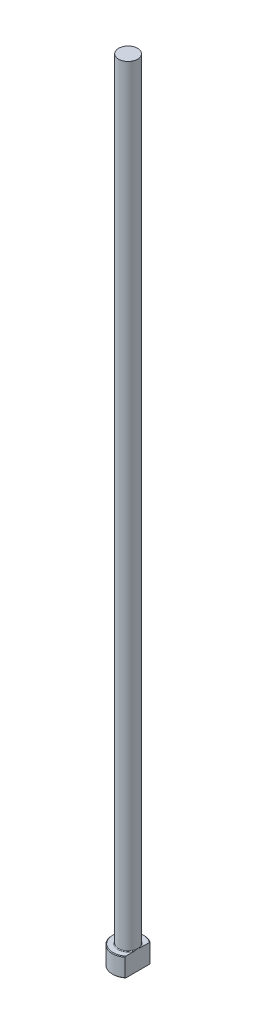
from build123d import *
from build123d.topology import SkipClean

# Parameters (mm, degrees)
CHAMFER1_SIZE    = 0.2
FILLET1_R        = 0.2
KEYED_HEAD_DEPTH = 251.099980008


with BuildPart() as part:
    # Sketch1 → Revolve1 (revolve)
    with BuildSketch(Plane.XY, mode=Mode.PRIVATE) as revolve1_sk:
        Polygon((0, 0), (-5, 0), (-5, 6), (-3, 6), (-3, 250), (0, 250), align=None)
    revolve(revolve1_sk.sketch.rotate(Axis((0, 259.958771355, 0), (0, -1, 0)), 270), axis=Axis((0, 259.958771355, 0), (0, -1, 0)))

    # Chamfer1
    chamfer1_edges = [part.edges().sort_by_distance(p)[0] for p in [
        (0, 6, -5),
        (0, 0, -5),
    ]]
    chamfer(chamfer1_edges, length=CHAMFER1_SIZE)

    # Fillet1
    fillet1_edges = [part.edges().sort_by_distance(p)[0] for p in [
        (0, 6, -3),
    ]]
    fillet(fillet1_edges, radius=FILLET1_R)

    # Sketch2 → KEYED HEAD (cut, through all)
    with SkipClean():  # the faces are left unmerged after this step: merging them gives an invalid solid
        with BuildSketch(Plane(origin=(0, 0, 0), x_dir=(1, 0, 0), z_dir=(0, 1, 0))):
            with BuildLine():
                Line((3, -4), (3, 4))
                ThreePointArc((3, 4), (5, 0), (3, -4))
            make_face()
        extrude(amount=KEYED_HEAD_DEPTH, mode=Mode.SUBTRACT)


solid = part.part
